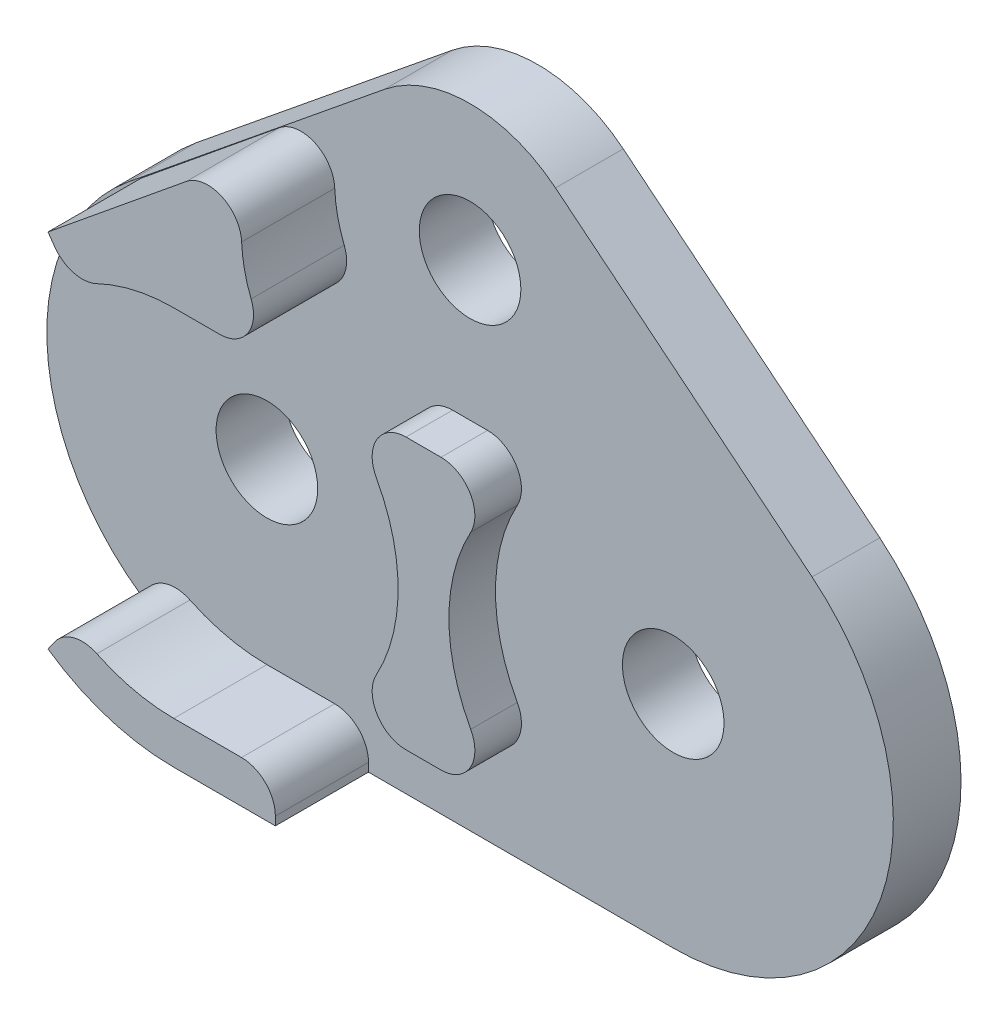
ISO-10303-21;
HEADER;
FILE_DESCRIPTION(('STEP AP214'),'2;1');
FILE_NAME('part.step','',(''),(''),'','','');
FILE_SCHEMA(('AUTOMOTIVE_DESIGN { 1 0 10303 214 1 1 1 1 }'));
ENDSEC;
DATA;
#1=APPLICATION_CONTEXT('core data for automotive mechanical design processes');
#2=APPLICATION_PROTOCOL_DEFINITION('international standard','automotive_design',2000,#1);
#3=PRODUCT_CONTEXT('',#1,'mechanical');
#4=PRODUCT('Part','Part','',(#3));
#5=PRODUCT_RELATED_PRODUCT_CATEGORY('part','',(#4));
#6=PRODUCT_DEFINITION_FORMATION('','',#4);
#7=PRODUCT_DEFINITION_CONTEXT('part definition',#1,'design');
#8=PRODUCT_DEFINITION('design','',#6,#7);
#9=PRODUCT_DEFINITION_SHAPE('','',#8);
#10=(LENGTH_UNIT() NAMED_UNIT(*) SI_UNIT(.MILLI.,.METRE.));
#11=(NAMED_UNIT(*) PLANE_ANGLE_UNIT() SI_UNIT($,.RADIAN.));
#12=(NAMED_UNIT(*) SI_UNIT($,.STERADIAN.) SOLID_ANGLE_UNIT());
#13=UNCERTAINTY_MEASURE_WITH_UNIT(LENGTH_MEASURE(1.E-05),#10,'distance_accuracy_value','');
#14=(GEOMETRIC_REPRESENTATION_CONTEXT(3) GLOBAL_UNCERTAINTY_ASSIGNED_CONTEXT((#13)) GLOBAL_UNIT_ASSIGNED_CONTEXT((#10,
#11,#12)) REPRESENTATION_CONTEXT('',''));
#15=CARTESIAN_POINT('',(0.,0.,0.));
#16=DIRECTION('',(0.,0.,1.));
#17=DIRECTION('',(1.,0.,0.));
#18=AXIS2_PLACEMENT_3D('',#15,#16,#17);
#19=CARTESIAN_POINT('',(-6.,0.,2.));
#20=DIRECTION('',(0.,0.,1.));
#21=DIRECTION('',(1.,0.,0.));
#22=AXIS2_PLACEMENT_3D('',#19,#20,#21);
#23=PLANE('',#22);
#24=CARTESIAN_POINT('',(0.,8.1,2.));
#25=DIRECTION('',(0.,0.,1.));
#26=DIRECTION('',(-1.,0.,0.));
#27=AXIS2_PLACEMENT_3D('',#24,#25,#26);
#28=CIRCLE('',#27,4.);
#29=CARTESIAN_POINT('',(2.52331386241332,11.2036892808,2.));
#30=VERTEX_POINT('',#29);
#31=CARTESIAN_POINT('',(-2.52331386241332,11.2036892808,2.));
#32=VERTEX_POINT('',#31);
#33=EDGE_CURVE('E327',#30,#32,#28,.T.);
#34=ORIENTED_EDGE('',*,*,#33,.T.);
#35=DIRECTION('',(-0.775922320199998,-0.63082846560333,0.));
#36=VECTOR('',#35,1.);
#37=CARTESIAN_POINT('',(-2.52331386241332,11.2036892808,2.));
#38=LINE('',#37,#36);
#39=CARTESIAN_POINT('',(-10.1003850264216,5.04349508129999,2.));
#40=VERTEX_POINT('',#39);
#41=EDGE_CURVE('E329',#32,#40,#38,.T.);
#42=ORIENTED_EDGE('',*,*,#41,.T.);
#43=CARTESIAN_POINT('',(-6.,0.,2.));
#44=DIRECTION('',(0.,0.,1.));
#45=DIRECTION('',(1.,0.,0.));
#46=AXIS2_PLACEMENT_3D('',#43,#44,#45);
#47=CIRCLE('',#46,6.5);
#48=CARTESIAN_POINT('',(-9.71428571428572,-5.33423674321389,2.));
#49=VERTEX_POINT('',#48);
#50=EDGE_CURVE('E356',#40,#49,#47,.T.);
#51=ORIENTED_EDGE('',*,*,#50,.T.);
#52=DIRECTION('',(-0.571428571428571,-0.82065180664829,0.));
#53=VECTOR('',#52,1.);
#54=CARTESIAN_POINT('',(-4.04081632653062,2.81366333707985,2.));
#55=LINE('',#54,#53);
#56=CARTESIAN_POINT('',(-9.52541790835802,-5.06299600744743,2.));
#57=VERTEX_POINT('',#56);
#58=EDGE_CURVE('E256',#57,#49,#55,.T.);
#59=ORIENTED_EDGE('',*,*,#58,.F.);
#60=CARTESIAN_POINT('',(-8.70476610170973,-5.634424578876,2.));
#61=DIRECTION('',(0.,0.,1.));
#62=DIRECTION('',(1.,0.,0.));
#63=AXIS2_PLACEMENT_3D('',#60,#61,#62);
#64=CIRCLE('',#63,1.);
#65=CARTESIAN_POINT('',(-8.27200352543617,-4.73291664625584,2.));
#66=VERTEX_POINT('',#65);
#67=EDGE_CURVE('E443',#57,#66,#64,.F.);
#68=ORIENTED_EDGE('',*,*,#67,.T.);
#69=CARTESIAN_POINT('',(-6.,0.,2.));
#70=DIRECTION('',(0.,0.,1.));
#71=DIRECTION('',(1.,0.,0.));
#72=AXIS2_PLACEMENT_3D('',#69,#70,#71);
#73=CIRCLE('',#72,5.25);
#74=CARTESIAN_POINT('',(-6.,-5.25,2.));
#75=VERTEX_POINT('',#74);
#76=EDGE_CURVE('E273',#75,#66,#73,.F.);
#77=ORIENTED_EDGE('',*,*,#76,.F.);
#78=DIRECTION('',(1.,0.,0.));
#79=VECTOR('',#78,1.);
#80=CARTESIAN_POINT('',(0.,-5.25,2.));
#81=LINE('',#80,#79);
#82=CARTESIAN_POINT('',(-4.,-5.25,2.));
#83=VERTEX_POINT('',#82);
#84=EDGE_CURVE('E235',#75,#83,#81,.T.);
#85=ORIENTED_EDGE('',*,*,#84,.T.);
#86=CARTESIAN_POINT('',(-4.,-6.25,2.));
#87=DIRECTION('',(0.,0.,1.));
#88=DIRECTION('',(1.,0.,0.));
#89=AXIS2_PLACEMENT_3D('',#86,#87,#88);
#90=CIRCLE('',#89,1.);
#91=CARTESIAN_POINT('',(-3.,-6.25,2.));
#92=VERTEX_POINT('',#91);
#93=EDGE_CURVE('E441',#83,#92,#90,.F.);
#94=ORIENTED_EDGE('',*,*,#93,.T.);
#95=DIRECTION('',(0.,-1.,0.));
#96=VECTOR('',#95,1.);
#97=CARTESIAN_POINT('',(-3.,0.,2.));
#98=LINE('',#97,#96);
#99=CARTESIAN_POINT('',(-3.,-6.5,2.));
#100=VERTEX_POINT('',#99);
#101=EDGE_CURVE('E254',#92,#100,#98,.T.);
#102=ORIENTED_EDGE('',*,*,#101,.T.);
#103=DIRECTION('',(1.,0.,0.));
#104=VECTOR('',#103,1.);
#105=CARTESIAN_POINT('',(-6.,-6.5,2.));
#106=LINE('',#105,#104);
#107=CARTESIAN_POINT('',(6.,-6.50000000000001,2.));
#108=VERTEX_POINT('',#107);
#109=EDGE_CURVE('E359',#100,#108,#106,.T.);
#110=ORIENTED_EDGE('',*,*,#109,.T.);
#111=CARTESIAN_POINT('',(6.,0.,2.));
#112=DIRECTION('',(0.,0.,1.));
#113=DIRECTION('',(-1.,0.,0.));
#114=AXIS2_PLACEMENT_3D('',#111,#112,#113);
#115=CIRCLE('',#114,6.5);
#116=CARTESIAN_POINT('',(10.1003850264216,5.04349508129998,2.));
#117=VERTEX_POINT('',#116);
#118=EDGE_CURVE('E362',#108,#117,#115,.T.);
#119=ORIENTED_EDGE('',*,*,#118,.T.);
#120=DIRECTION('',(-0.775922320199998,0.63082846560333,0.));
#121=VECTOR('',#120,1.);
#122=CARTESIAN_POINT('',(2.52331386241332,11.2036892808,2.));
#123=LINE('',#122,#121);
#124=EDGE_CURVE('E324',#117,#30,#123,.T.);
#125=ORIENTED_EDGE('',*,*,#124,.T.);
#126=EDGE_LOOP('',(#34,#42,#51,#59,#68,#77,#85,#94,#102,#110,#119,#125));
#127=FACE_BOUND('',#126,.T.);
#128=CARTESIAN_POINT('',(-4.9957863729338,7.89477203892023,2.));
#129=DIRECTION('',(0.,0.,1.));
#130=DIRECTION('',(1.,0.,0.));
#131=AXIS2_PLACEMENT_3D('',#128,#129,#130);
#132=CIRCLE('',#131,1.);
#133=CARTESIAN_POINT('',(-5.6281157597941,8.66947168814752,2.));
#134=VERTEX_POINT('',#133);
#135=CARTESIAN_POINT('',(-3.99662909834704,7.93581763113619,2.));
#136=VERTEX_POINT('',#135);
#137=EDGE_CURVE('E11',#134,#136,#132,.F.);
#138=ORIENTED_EDGE('',*,*,#137,.T.);
#139=CARTESIAN_POINT('',(0.,8.1,2.));
#140=DIRECTION('',(0.,0.,1.));
#141=DIRECTION('',(1.,0.,0.));
#142=AXIS2_PLACEMENT_3D('',#139,#140,#141);
#143=CIRCLE('',#142,4.);
#144=CARTESIAN_POINT('',(-3.71612701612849,6.62,2.));
#145=VERTEX_POINT('',#144);
#146=EDGE_CURVE('E50',#145,#136,#143,.F.);
#147=ORIENTED_EDGE('',*,*,#146,.F.);
#148=CARTESIAN_POINT('',(-4.64515877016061,6.25,2.));
#149=DIRECTION('',(0.,0.,1.));
#150=DIRECTION('',(1.,0.,0.));
#151=AXIS2_PLACEMENT_3D('',#148,#149,#150);
#152=CIRCLE('',#151,1.);
#153=CARTESIAN_POINT('',(-4.64515877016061,5.25,2.));
#154=VERTEX_POINT('',#153);
#155=EDGE_CURVE('E43',#145,#154,#152,.F.);
#156=ORIENTED_EDGE('',*,*,#155,.T.);
#157=DIRECTION('',(1.,0.,0.));
#158=VECTOR('',#157,1.);
#159=CARTESIAN_POINT('',(0.,5.25,2.));
#160=LINE('',#159,#158);
#161=CARTESIAN_POINT('',(-6.,5.25,2.));
#162=VERTEX_POINT('',#161);
#163=EDGE_CURVE('E238',#162,#154,#160,.T.);
#164=ORIENTED_EDGE('',*,*,#163,.F.);
#165=CARTESIAN_POINT('',(-6.,0.,2.));
#166=DIRECTION('',(0.,0.,1.));
#167=DIRECTION('',(1.,0.,0.));
#168=AXIS2_PLACEMENT_3D('',#165,#166,#167);
#169=CIRCLE('',#168,5.25);
#170=CARTESIAN_POINT('',(-8.27200352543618,4.73291664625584,2.));
#171=VERTEX_POINT('',#170);
#172=EDGE_CURVE('E285',#162,#171,#169,.T.);
#173=ORIENTED_EDGE('',*,*,#172,.T.);
#174=CARTESIAN_POINT('',(-8.70476610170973,5.634424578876,2.));
#175=DIRECTION('',(0.,0.,1.));
#176=DIRECTION('',(1.,0.,0.));
#177=AXIS2_PLACEMENT_3D('',#174,#175,#176);
#178=CIRCLE('',#177,1.);
#179=CARTESIAN_POINT('',(-9.52541790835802,5.06299600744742,2.));
#180=VERTEX_POINT('',#179);
#181=EDGE_CURVE('E445',#171,#180,#178,.F.);
#182=ORIENTED_EDGE('',*,*,#181,.T.);
#183=DIRECTION('',(-0.571428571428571,0.82065180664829,0.));
#184=VECTOR('',#183,1.);
#185=CARTESIAN_POINT('',(-4.04081632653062,-2.81366333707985,2.));
#186=LINE('',#185,#184);
#187=CARTESIAN_POINT('',(-9.71428571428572,5.33423674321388,2.));
#188=VERTEX_POINT('',#187);
#189=EDGE_CURVE('E303',#180,#188,#186,.T.);
#190=ORIENTED_EDGE('',*,*,#189,.T.);
#191=DIRECTION('',(0.774699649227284,0.6323293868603,0.));
#192=VECTOR('',#191,1.);
#193=CARTESIAN_POINT('',(-6.49722217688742,7.96008511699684,2.));
#194=LINE('',#193,#192);
#195=EDGE_CURVE('E300',#188,#134,#194,.T.);
#196=ORIENTED_EDGE('',*,*,#195,.T.);
#197=EDGE_LOOP('',(#138,#147,#156,#164,#173,#182,#190,#196));
#198=FACE_BOUND('',#197,.T.);
#199=CARTESIAN_POINT('',(6.,0.,2.));
#200=DIRECTION('',(0.,0.,1.));
#201=DIRECTION('',(1.,0.,0.));
#202=AXIS2_PLACEMENT_3D('',#199,#200,#201);
#203=CIRCLE('',#202,1.5);
#204=CARTESIAN_POINT('',(7.5,0.,2.));
#205=VERTEX_POINT('',#204);
#206=EDGE_CURVE('E343',#205,#205,#203,.T.);
#207=ORIENTED_EDGE('',*,*,#206,.F.);
#208=EDGE_LOOP('',(#207));
#209=FACE_BOUND('',#208,.T.);
#210=CARTESIAN_POINT('',(-6.,0.,2.));
#211=DIRECTION('',(0.,0.,1.));
#212=DIRECTION('',(1.,0.,0.));
#213=AXIS2_PLACEMENT_3D('',#210,#211,#212);
#214=CIRCLE('',#213,1.5);
#215=CARTESIAN_POINT('',(-4.5,0.,2.));
#216=VERTEX_POINT('',#215);
#217=EDGE_CURVE('E347',#216,#216,#214,.T.);
#218=ORIENTED_EDGE('',*,*,#217,.F.);
#219=EDGE_LOOP('',(#218));
#220=FACE_BOUND('',#219,.T.);
#221=CARTESIAN_POINT('',(0.,8.1,2.));
#222=DIRECTION('',(0.,0.,1.));
#223=DIRECTION('',(1.,0.,0.));
#224=AXIS2_PLACEMENT_3D('',#221,#222,#223);
#225=CIRCLE('',#224,1.5);
#226=CARTESIAN_POINT('',(1.5,8.1,2.));
#227=VERTEX_POINT('',#226);
#228=EDGE_CURVE('E312',#227,#227,#225,.T.);
#229=ORIENTED_EDGE('',*,*,#228,.F.);
#230=EDGE_LOOP('',(#229));
#231=FACE_BOUND('',#230,.T.);
#232=DIRECTION('',(1.,0.,0.));
#233=VECTOR('',#232,1.);
#234=CARTESIAN_POINT('',(-2.59963237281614,-4.,2.));
#235=LINE('',#234,#233);
#236=CARTESIAN_POINT('',(-0.517071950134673,-4.,2.));
#237=VERTEX_POINT('',#236);
#238=CARTESIAN_POINT('',(0.517071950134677,-4.,2.));
#239=VERTEX_POINT('',#238);
#240=EDGE_CURVE('E837',#237,#239,#235,.T.);
#241=ORIENTED_EDGE('',*,*,#240,.F.);
#242=CARTESIAN_POINT('',(-0.517071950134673,-3.,2.));
#243=DIRECTION('',(0.,0.,1.));
#244=DIRECTION('',(1.,0.,0.));
#245=AXIS2_PLACEMENT_3D('',#242,#243,#244);
#246=CIRCLE('',#245,1.);
#247=CARTESIAN_POINT('',(-1.39434043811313,-2.52,2.));
#248=VERTEX_POINT('',#247);
#249=EDGE_CURVE('E433',#237,#248,#246,.F.);
#250=ORIENTED_EDGE('',*,*,#249,.T.);
#251=CARTESIAN_POINT('',(-6.,0.,2.));
#252=DIRECTION('',(0.,0.,-1.));
#253=DIRECTION('',(-1.,0.,0.));
#254=AXIS2_PLACEMENT_3D('',#251,#252,#253);
#255=CIRCLE('',#254,5.25);
#256=CARTESIAN_POINT('',(-1.39434043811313,2.52,2.));
#257=VERTEX_POINT('',#256);
#258=EDGE_CURVE('E843',#257,#248,#255,.T.);
#259=ORIENTED_EDGE('',*,*,#258,.F.);
#260=CARTESIAN_POINT('',(-0.517071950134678,3.,2.));
#261=DIRECTION('',(0.,0.,1.));
#262=DIRECTION('',(1.,0.,0.));
#263=AXIS2_PLACEMENT_3D('',#260,#261,#262);
#264=CIRCLE('',#263,1.);
#265=CARTESIAN_POINT('',(-0.517071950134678,4.,2.));
#266=VERTEX_POINT('',#265);
#267=EDGE_CURVE('E439',#257,#266,#264,.F.);
#268=ORIENTED_EDGE('',*,*,#267,.T.);
#269=DIRECTION('',(-1.,0.,0.));
#270=VECTOR('',#269,1.);
#271=CARTESIAN_POINT('',(-2.59963237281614,4.,2.));
#272=LINE('',#271,#270);
#273=CARTESIAN_POINT('',(0.51707195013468,4.,2.));
#274=VERTEX_POINT('',#273);
#275=EDGE_CURVE('E259',#274,#266,#272,.T.);
#276=ORIENTED_EDGE('',*,*,#275,.F.);
#277=CARTESIAN_POINT('',(0.51707195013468,3.,2.));
#278=DIRECTION('',(0.,0.,1.));
#279=DIRECTION('',(1.,0.,0.));
#280=AXIS2_PLACEMENT_3D('',#277,#278,#279);
#281=CIRCLE('',#280,1.);
#282=CARTESIAN_POINT('',(1.39434043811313,2.52,2.));
#283=VERTEX_POINT('',#282);
#284=EDGE_CURVE('E437',#274,#283,#281,.F.);
#285=ORIENTED_EDGE('',*,*,#284,.T.);
#286=CARTESIAN_POINT('',(6.,0.,2.));
#287=DIRECTION('',(0.,0.,-1.));
#288=DIRECTION('',(1.,0.,0.));
#289=AXIS2_PLACEMENT_3D('',#286,#287,#288);
#290=CIRCLE('',#289,5.25);
#291=CARTESIAN_POINT('',(1.39434043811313,-2.52,2.));
#292=VERTEX_POINT('',#291);
#293=EDGE_CURVE('E842',#292,#283,#290,.T.);
#294=ORIENTED_EDGE('',*,*,#293,.F.);
#295=CARTESIAN_POINT('',(0.517071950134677,-3.,2.));
#296=DIRECTION('',(0.,0.,1.));
#297=DIRECTION('',(1.,0.,0.));
#298=AXIS2_PLACEMENT_3D('',#295,#296,#297);
#299=CIRCLE('',#298,1.);
#300=EDGE_CURVE('E435',#292,#239,#299,.F.);
#301=ORIENTED_EDGE('',*,*,#300,.T.);
#302=EDGE_LOOP('',(#241,#250,#259,#268,#276,#285,#294,#301));
#303=FACE_BOUND('',#302,.T.);
#304=ADVANCED_FACE('F35',(#127,#198,#209,#220,#231,#303),#23,.T.);
#305=CARTESIAN_POINT('',(6.,0.,2.));
#306=DIRECTION('',(0.,0.,-1.));
#307=DIRECTION('',(-1.,0.,0.));
#308=AXIS2_PLACEMENT_3D('',#305,#306,#307);
#309=CYLINDRICAL_SURFACE('',#308,6.5);
#310=DIRECTION('',(0.,0.,1.));
#311=VECTOR('',#310,1.);
#312=CARTESIAN_POINT('',(10.1003850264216,5.04349508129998,-21.3977889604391));
#313=LINE('',#312,#311);
#314=CARTESIAN_POINT('',(10.1003850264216,5.04349508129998,0.));
#315=VERTEX_POINT('',#314);
#316=EDGE_CURVE('E332',#315,#117,#313,.T.);
#317=ORIENTED_EDGE('',*,*,#316,.T.);
#318=ORIENTED_EDGE('',*,*,#118,.F.);
#319=DIRECTION('',(0.,0.,-1.));
#320=VECTOR('',#319,1.);
#321=CARTESIAN_POINT('',(6.,-6.50000000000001,2.));
#322=LINE('',#321,#320);
#323=CARTESIAN_POINT('',(6.,-6.50000000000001,0.));
#324=VERTEX_POINT('',#323);
#325=EDGE_CURVE('E365',#108,#324,#322,.T.);
#326=ORIENTED_EDGE('',*,*,#325,.T.);
#327=CARTESIAN_POINT('',(6.,0.,0.));
#328=DIRECTION('',(0.,0.,1.));
#329=DIRECTION('',(-1.,0.,0.));
#330=AXIS2_PLACEMENT_3D('',#327,#328,#329);
#331=CIRCLE('',#330,6.5);
#332=EDGE_CURVE('E360',#324,#315,#331,.T.);
#333=ORIENTED_EDGE('',*,*,#332,.T.);
#334=EDGE_LOOP('',(#317,#318,#326,#333));
#335=FACE_BOUND('',#334,.T.);
#336=ADVANCED_FACE('F488',(#335),#309,.T.);
#337=CARTESIAN_POINT('',(-6.,0.,2.));
#338=DIRECTION('',(0.,0.,-1.));
#339=DIRECTION('',(-1.,0.,0.));
#340=AXIS2_PLACEMENT_3D('',#337,#338,#339);
#341=CYLINDRICAL_SURFACE('',#340,6.5);
#342=ORIENTED_EDGE('',*,*,#50,.F.);
#343=DIRECTION('',(0.,0.,1.));
#344=VECTOR('',#343,1.);
#345=CARTESIAN_POINT('',(-10.1003850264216,5.04349508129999,-21.3977889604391));
#346=LINE('',#345,#344);
#347=CARTESIAN_POINT('',(-10.1003850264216,5.04349508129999,0.));
#348=VERTEX_POINT('',#347);
#349=EDGE_CURVE('E317',#348,#40,#346,.T.);
#350=ORIENTED_EDGE('',*,*,#349,.F.);
#351=CARTESIAN_POINT('',(-6.,0.,0.));
#352=DIRECTION('',(0.,0.,1.));
#353=DIRECTION('',(1.,0.,0.));
#354=AXIS2_PLACEMENT_3D('',#351,#352,#353);
#355=CIRCLE('',#354,6.5);
#356=CARTESIAN_POINT('',(-6.,-6.5,0.));
#357=VERTEX_POINT('',#356);
#358=EDGE_CURVE('E353',#348,#357,#355,.T.);
#359=ORIENTED_EDGE('',*,*,#358,.T.);
#360=DIRECTION('',(0.,0.,-1.));
#361=VECTOR('',#360,1.);
#362=CARTESIAN_POINT('',(-6.,-6.5,2.));
#363=LINE('',#362,#361);
#364=CARTESIAN_POINT('',(-6.,-6.5,4.75));
#365=VERTEX_POINT('',#364);
#366=EDGE_CURVE('E372',#365,#357,#363,.T.);
#367=ORIENTED_EDGE('',*,*,#366,.F.);
#368=CARTESIAN_POINT('',(-6.,0.,4.75));
#369=DIRECTION('',(0.,0.,1.));
#370=DIRECTION('',(1.,0.,0.));
#371=AXIS2_PLACEMENT_3D('',#368,#369,#370);
#372=CIRCLE('',#371,6.5);
#373=CARTESIAN_POINT('',(-9.71428571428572,-5.33423674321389,4.75));
#374=VERTEX_POINT('',#373);
#375=EDGE_CURVE('E263',#374,#365,#372,.T.);
#376=ORIENTED_EDGE('',*,*,#375,.F.);
#377=DIRECTION('',(0.,0.,-1.));
#378=VECTOR('',#377,1.);
#379=CARTESIAN_POINT('',(-9.71428571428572,-5.33423674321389,4.75));
#380=LINE('',#379,#378);
#381=EDGE_CURVE('E239',#374,#49,#380,.T.);
#382=ORIENTED_EDGE('',*,*,#381,.T.);
#383=EDGE_LOOP('',(#342,#350,#359,#367,#376,#382));
#384=FACE_BOUND('',#383,.T.);
#385=ADVANCED_FACE('F494',(#384),#341,.T.);
#386=CARTESIAN_POINT('',(-6.,-6.5,2.));
#387=DIRECTION('',(0.,1.,0.));
#388=DIRECTION('',(0.,0.,1.));
#389=AXIS2_PLACEMENT_3D('',#386,#387,#388);
#390=PLANE('',#389);
#391=DIRECTION('',(1.,0.,0.));
#392=VECTOR('',#391,1.);
#393=CARTESIAN_POINT('',(-6.,-6.5,0.));
#394=LINE('',#393,#392);
#395=EDGE_CURVE('E367',#357,#324,#394,.T.);
#396=ORIENTED_EDGE('',*,*,#395,.T.);
#397=ORIENTED_EDGE('',*,*,#325,.F.);
#398=ORIENTED_EDGE('',*,*,#109,.F.);
#399=DIRECTION('',(0.,0.,-1.));
#400=VECTOR('',#399,1.);
#401=CARTESIAN_POINT('',(-3.,-6.5,4.75));
#402=LINE('',#401,#400);
#403=CARTESIAN_POINT('',(-3.,-6.5,4.75));
#404=VERTEX_POINT('',#403);
#405=EDGE_CURVE('E271',#404,#100,#402,.T.);
#406=ORIENTED_EDGE('',*,*,#405,.F.);
#407=DIRECTION('',(1.,0.,0.));
#408=VECTOR('',#407,1.);
#409=CARTESIAN_POINT('',(0.,-6.5,4.75));
#410=LINE('',#409,#408);
#411=EDGE_CURVE('E266',#365,#404,#410,.T.);
#412=ORIENTED_EDGE('',*,*,#411,.F.);
#413=ORIENTED_EDGE('',*,*,#366,.T.);
#414=EDGE_LOOP('',(#396,#397,#398,#406,#412,#413));
#415=FACE_BOUND('',#414,.T.);
#416=ADVANCED_FACE('F503',(#415),#390,.F.);
#417=CARTESIAN_POINT('',(-6.,0.,0.));
#418=DIRECTION('',(0.,0.,1.));
#419=DIRECTION('',(1.,0.,0.));
#420=AXIS2_PLACEMENT_3D('',#417,#418,#419);
#421=PLANE('',#420);
#422=ORIENTED_EDGE('',*,*,#358,.F.);
#423=DIRECTION('',(0.775922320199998,0.63082846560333,0.));
#424=VECTOR('',#423,1.);
#425=CARTESIAN_POINT('',(-2.52331386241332,11.2036892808,0.));
#426=LINE('',#425,#424);
#427=CARTESIAN_POINT('',(-2.52331386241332,11.2036892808,0.));
#428=VERTEX_POINT('',#427);
#429=EDGE_CURVE('E319',#348,#428,#426,.T.);
#430=ORIENTED_EDGE('',*,*,#429,.T.);
#431=CARTESIAN_POINT('',(0.,8.1,0.));
#432=DIRECTION('',(0.,0.,1.));
#433=DIRECTION('',(1.,0.,0.));
#434=AXIS2_PLACEMENT_3D('',#431,#432,#433);
#435=CIRCLE('',#434,4.);
#436=CARTESIAN_POINT('',(2.52331386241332,11.2036892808,0.));
#437=VERTEX_POINT('',#436);
#438=EDGE_CURVE('E316',#428,#437,#435,.F.);
#439=ORIENTED_EDGE('',*,*,#438,.T.);
#440=DIRECTION('',(0.775922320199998,-0.63082846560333,0.));
#441=VECTOR('',#440,1.);
#442=CARTESIAN_POINT('',(2.52331386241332,11.2036892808,0.));
#443=LINE('',#442,#441);
#444=EDGE_CURVE('E313',#437,#315,#443,.T.);
#445=ORIENTED_EDGE('',*,*,#444,.T.);
#446=ORIENTED_EDGE('',*,*,#332,.F.);
#447=ORIENTED_EDGE('',*,*,#395,.F.);
#448=EDGE_LOOP('',(#422,#430,#439,#445,#446,#447));
#449=FACE_BOUND('',#448,.T.);
#450=CARTESIAN_POINT('',(6.,0.,0.));
#451=DIRECTION('',(0.,0.,1.));
#452=DIRECTION('',(1.,0.,0.));
#453=AXIS2_PLACEMENT_3D('',#450,#451,#452);
#454=CIRCLE('',#453,1.5);
#455=CARTESIAN_POINT('',(7.5,0.,0.));
#456=VERTEX_POINT('',#455);
#457=EDGE_CURVE('E344',#456,#456,#454,.T.);
#458=ORIENTED_EDGE('',*,*,#457,.T.);
#459=EDGE_LOOP('',(#458));
#460=FACE_BOUND('',#459,.T.);
#461=CARTESIAN_POINT('',(-6.,0.,0.));
#462=DIRECTION('',(0.,0.,1.));
#463=DIRECTION('',(1.,0.,0.));
#464=AXIS2_PLACEMENT_3D('',#461,#462,#463);
#465=CIRCLE('',#464,1.5);
#466=CARTESIAN_POINT('',(-4.5,0.,0.));
#467=VERTEX_POINT('',#466);
#468=EDGE_CURVE('E350',#467,#467,#465,.T.);
#469=ORIENTED_EDGE('',*,*,#468,.T.);
#470=EDGE_LOOP('',(#469));
#471=FACE_BOUND('',#470,.T.);
#472=CARTESIAN_POINT('',(0.,8.1,0.));
#473=DIRECTION('',(0.,0.,1.));
#474=DIRECTION('',(1.,0.,0.));
#475=AXIS2_PLACEMENT_3D('',#472,#473,#474);
#476=CIRCLE('',#475,1.5);
#477=CARTESIAN_POINT('',(1.5,8.1,0.));
#478=VERTEX_POINT('',#477);
#479=EDGE_CURVE('E321',#478,#478,#476,.F.);
#480=ORIENTED_EDGE('',*,*,#479,.F.);
#481=EDGE_LOOP('',(#480));
#482=FACE_BOUND('',#481,.T.);
#483=ADVANCED_FACE('F501',(#449,#460,#471,#482),#421,.F.);
#484=CARTESIAN_POINT('',(-6.,0.,0.));
#485=DIRECTION('',(0.,0.,1.));
#486=DIRECTION('',(1.,0.,0.));
#487=AXIS2_PLACEMENT_3D('',#484,#485,#486);
#488=CYLINDRICAL_SURFACE('',#487,1.5);
#489=ORIENTED_EDGE('',*,*,#468,.F.);
#490=EDGE_LOOP('',(#489));
#491=FACE_BOUND('',#490,.T.);
#492=ORIENTED_EDGE('',*,*,#217,.T.);
#493=EDGE_LOOP('',(#492));
#494=FACE_BOUND('',#493,.T.);
#495=ADVANCED_FACE('F499',(#491,#494),#488,.F.);
#496=CARTESIAN_POINT('',(6.,0.,0.));
#497=DIRECTION('',(0.,0.,1.));
#498=DIRECTION('',(1.,0.,0.));
#499=AXIS2_PLACEMENT_3D('',#496,#497,#498);
#500=CYLINDRICAL_SURFACE('',#499,1.5);
#501=ORIENTED_EDGE('',*,*,#457,.F.);
#502=EDGE_LOOP('',(#501));
#503=FACE_BOUND('',#502,.T.);
#504=ORIENTED_EDGE('',*,*,#206,.T.);
#505=EDGE_LOOP('',(#504));
#506=FACE_BOUND('',#505,.T.);
#507=ADVANCED_FACE('F782',(#503,#506),#500,.F.);
#508=CARTESIAN_POINT('',(2.52331386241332,11.2036892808,-21.3977889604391));
#509=DIRECTION('',(0.63082846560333,0.775922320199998,0.));
#510=DIRECTION('',(-0.775922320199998,0.63082846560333,0.));
#511=AXIS2_PLACEMENT_3D('',#508,#509,#510);
#512=PLANE('',#511);
#513=ORIENTED_EDGE('',*,*,#444,.F.);
#514=DIRECTION('',(0.,0.,1.));
#515=VECTOR('',#514,1.);
#516=CARTESIAN_POINT('',(2.52331386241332,11.2036892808,-21.3977889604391));
#517=LINE('',#516,#515);
#518=EDGE_CURVE('E338',#437,#30,#517,.T.);
#519=ORIENTED_EDGE('',*,*,#518,.T.);
#520=ORIENTED_EDGE('',*,*,#124,.F.);
#521=ORIENTED_EDGE('',*,*,#316,.F.);
#522=EDGE_LOOP('',(#513,#519,#520,#521));
#523=FACE_BOUND('',#522,.T.);
#524=ADVANCED_FACE('F772',(#523),#512,.T.);
#525=CARTESIAN_POINT('',(0.,8.1,-21.3977889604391));
#526=DIRECTION('',(0.,0.,1.));
#527=DIRECTION('',(1.,0.,0.));
#528=AXIS2_PLACEMENT_3D('',#525,#526,#527);
#529=CYLINDRICAL_SURFACE('',#528,4.);
#530=ORIENTED_EDGE('',*,*,#438,.F.);
#531=DIRECTION('',(0.,0.,1.));
#532=VECTOR('',#531,1.);
#533=CARTESIAN_POINT('',(-2.52331386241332,11.2036892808,-21.3977889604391));
#534=LINE('',#533,#532);
#535=EDGE_CURVE('E335',#428,#32,#534,.T.);
#536=ORIENTED_EDGE('',*,*,#535,.T.);
#537=ORIENTED_EDGE('',*,*,#33,.F.);
#538=ORIENTED_EDGE('',*,*,#518,.F.);
#539=EDGE_LOOP('',(#530,#536,#537,#538));
#540=FACE_BOUND('',#539,.T.);
#541=ADVANCED_FACE('F762',(#540),#529,.T.);
#542=CARTESIAN_POINT('',(-2.52331386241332,11.2036892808,-21.3977889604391));
#543=DIRECTION('',(-0.63082846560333,0.775922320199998,0.));
#544=DIRECTION('',(-0.775922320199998,-0.63082846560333,0.));
#545=AXIS2_PLACEMENT_3D('',#542,#543,#544);
#546=PLANE('',#545);
#547=ORIENTED_EDGE('',*,*,#429,.F.);
#548=ORIENTED_EDGE('',*,*,#349,.T.);
#549=ORIENTED_EDGE('',*,*,#41,.F.);
#550=ORIENTED_EDGE('',*,*,#535,.F.);
#551=EDGE_LOOP('',(#547,#548,#549,#550));
#552=FACE_BOUND('',#551,.T.);
#553=ADVANCED_FACE('F752',(#552),#546,.T.);
#554=CARTESIAN_POINT('',(0.,8.1,-21.3977889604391));
#555=DIRECTION('',(0.,0.,1.));
#556=DIRECTION('',(1.,0.,0.));
#557=AXIS2_PLACEMENT_3D('',#554,#555,#556);
#558=CYLINDRICAL_SURFACE('',#557,1.5);
#559=ORIENTED_EDGE('',*,*,#479,.T.);
#560=EDGE_LOOP('',(#559));
#561=FACE_BOUND('',#560,.T.);
#562=ORIENTED_EDGE('',*,*,#228,.T.);
#563=EDGE_LOOP('',(#562));
#564=FACE_BOUND('',#563,.T.);
#565=ADVANCED_FACE('F725',(#561,#564),#558,.F.);
#566=CARTESIAN_POINT('',(0.,5.25,4.75));
#567=DIRECTION('',(0.,1.,0.));
#568=DIRECTION('',(0.,0.,1.));
#569=AXIS2_PLACEMENT_3D('',#566,#567,#568);
#570=PLANE('',#569);
#571=ORIENTED_EDGE('',*,*,#163,.T.);
#572=DIRECTION('',(0.,0.,-1.));
#573=VECTOR('',#572,1.);
#574=CARTESIAN_POINT('',(-4.64515877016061,5.25,4.75));
#575=LINE('',#574,#573);
#576=CARTESIAN_POINT('',(-4.64515877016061,5.25,4.75));
#577=VERTEX_POINT('',#576);
#578=EDGE_CURVE('E429',#154,#577,#575,.F.);
#579=ORIENTED_EDGE('',*,*,#578,.T.);
#580=DIRECTION('',(1.,0.,0.));
#581=VECTOR('',#580,1.);
#582=CARTESIAN_POINT('',(0.,5.25,4.75));
#583=LINE('',#582,#581);
#584=CARTESIAN_POINT('',(-6.,5.25,4.75));
#585=VERTEX_POINT('',#584);
#586=EDGE_CURVE('E281',#585,#577,#583,.T.);
#587=ORIENTED_EDGE('',*,*,#586,.F.);
#588=DIRECTION('',(0.,0.,-1.));
#589=VECTOR('',#588,1.);
#590=CARTESIAN_POINT('',(-6.,5.25,4.75));
#591=LINE('',#590,#589);
#592=EDGE_CURVE('E296',#585,#162,#591,.T.);
#593=ORIENTED_EDGE('',*,*,#592,.T.);
#594=EDGE_LOOP('',(#571,#579,#587,#593));
#595=FACE_BOUND('',#594,.T.);
#596=ADVANCED_FACE('F452',(#595),#570,.F.);
#597=CARTESIAN_POINT('',(0.,8.1,4.75));
#598=DIRECTION('',(0.,0.,-1.));
#599=DIRECTION('',(-1.,0.,0.));
#600=AXIS2_PLACEMENT_3D('',#597,#598,#599);
#601=CYLINDRICAL_SURFACE('',#600,4.);
#602=CARTESIAN_POINT('',(0.,8.1,4.75));
#603=DIRECTION('',(0.,0.,1.));
#604=DIRECTION('',(1.,0.,0.));
#605=AXIS2_PLACEMENT_3D('',#602,#603,#604);
#606=CIRCLE('',#605,4.);
#607=CARTESIAN_POINT('',(-3.71612701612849,6.62,4.75));
#608=VERTEX_POINT('',#607);
#609=CARTESIAN_POINT('',(-3.99662909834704,7.93581763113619,4.75));
#610=VERTEX_POINT('',#609);
#611=EDGE_CURVE('E284',#608,#610,#606,.F.);
#612=ORIENTED_EDGE('',*,*,#611,.F.);
#613=DIRECTION('',(0.,0.,-1.));
#614=VECTOR('',#613,1.);
#615=CARTESIAN_POINT('',(-3.71612701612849,6.62,4.75));
#616=LINE('',#615,#614);
#617=EDGE_CURVE('E427',#608,#145,#616,.T.);
#618=ORIENTED_EDGE('',*,*,#617,.T.);
#619=ORIENTED_EDGE('',*,*,#146,.T.);
#620=DIRECTION('',(0.,0.,-1.));
#621=VECTOR('',#620,1.);
#622=CARTESIAN_POINT('',(-3.99662909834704,7.93581763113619,4.75));
#623=LINE('',#622,#621);
#624=EDGE_CURVE('E425',#136,#610,#623,.F.);
#625=ORIENTED_EDGE('',*,*,#624,.T.);
#626=EDGE_LOOP('',(#612,#618,#619,#625));
#627=FACE_BOUND('',#626,.T.);
#628=ADVANCED_FACE('F463',(#627),#601,.F.);
#629=CARTESIAN_POINT('',(-6.49722217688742,7.96008511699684,4.75));
#630=DIRECTION('',(-0.6323293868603,0.774699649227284,0.));
#631=DIRECTION('',(-0.774699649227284,-0.6323293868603,0.));
#632=AXIS2_PLACEMENT_3D('',#629,#630,#631);
#633=PLANE('',#632);
#634=DIRECTION('',(0.774699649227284,0.6323293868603,0.));
#635=VECTOR('',#634,1.);
#636=CARTESIAN_POINT('',(-6.49722217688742,7.96008511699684,4.75));
#637=LINE('',#636,#635);
#638=CARTESIAN_POINT('',(-9.71428571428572,5.33423674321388,4.75));
#639=VERTEX_POINT('',#638);
#640=CARTESIAN_POINT('',(-5.6281157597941,8.66947168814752,4.75));
#641=VERTEX_POINT('',#640);
#642=EDGE_CURVE('E288',#639,#641,#637,.T.);
#643=ORIENTED_EDGE('',*,*,#642,.T.);
#644=DIRECTION('',(0.,0.,1.));
#645=VECTOR('',#644,1.);
#646=CARTESIAN_POINT('',(-5.6281157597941,8.66947168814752,2.));
#647=LINE('',#646,#645);
#648=EDGE_CURVE('E431',#641,#134,#647,.F.);
#649=ORIENTED_EDGE('',*,*,#648,.T.);
#650=ORIENTED_EDGE('',*,*,#195,.F.);
#651=DIRECTION('',(0.,0.,-1.));
#652=VECTOR('',#651,1.);
#653=CARTESIAN_POINT('',(-9.71428571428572,5.33423674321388,4.75));
#654=LINE('',#653,#652);
#655=EDGE_CURVE('E309',#639,#188,#654,.T.);
#656=ORIENTED_EDGE('',*,*,#655,.F.);
#657=EDGE_LOOP('',(#643,#649,#650,#656));
#658=FACE_BOUND('',#657,.T.);
#659=ADVANCED_FACE('F467',(#658),#633,.T.);
#660=CARTESIAN_POINT('',(-4.04081632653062,-2.81366333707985,4.75));
#661=DIRECTION('',(-0.82065180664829,-0.571428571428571,0.));
#662=DIRECTION('',(0.571428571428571,-0.82065180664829,0.));
#663=AXIS2_PLACEMENT_3D('',#660,#661,#662);
#664=PLANE('',#663);
#665=ORIENTED_EDGE('',*,*,#189,.F.);
#666=DIRECTION('',(0.,0.,-1.));
#667=VECTOR('',#666,1.);
#668=CARTESIAN_POINT('',(-9.52541790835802,5.06299600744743,4.75));
#669=LINE('',#668,#667);
#670=CARTESIAN_POINT('',(-9.52541790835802,5.06299600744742,4.75));
#671=VERTEX_POINT('',#670);
#672=EDGE_CURVE('E417',#180,#671,#669,.F.);
#673=ORIENTED_EDGE('',*,*,#672,.T.);
#674=DIRECTION('',(-0.571428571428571,0.82065180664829,0.));
#675=VECTOR('',#674,1.);
#676=CARTESIAN_POINT('',(-4.04081632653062,-2.81366333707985,4.75));
#677=LINE('',#676,#675);
#678=EDGE_CURVE('E291',#671,#639,#677,.T.);
#679=ORIENTED_EDGE('',*,*,#678,.T.);
#680=ORIENTED_EDGE('',*,*,#655,.T.);
#681=EDGE_LOOP('',(#665,#673,#679,#680));
#682=FACE_BOUND('',#681,.T.);
#683=ADVANCED_FACE('F471',(#682),#664,.T.);
#684=CARTESIAN_POINT('',(-6.,0.,4.75));
#685=DIRECTION('',(0.,0.,-1.));
#686=DIRECTION('',(-1.,0.,0.));
#687=AXIS2_PLACEMENT_3D('',#684,#685,#686);
#688=CYLINDRICAL_SURFACE('',#687,5.25);
#689=CARTESIAN_POINT('',(-6.,0.,4.75));
#690=DIRECTION('',(0.,0.,1.));
#691=DIRECTION('',(1.,0.,0.));
#692=AXIS2_PLACEMENT_3D('',#689,#690,#691);
#693=CIRCLE('',#692,5.25);
#694=CARTESIAN_POINT('',(-8.27200352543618,4.73291664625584,4.75));
#695=VERTEX_POINT('',#694);
#696=EDGE_CURVE('E293',#585,#695,#693,.T.);
#697=ORIENTED_EDGE('',*,*,#696,.T.);
#698=DIRECTION('',(0.,0.,-1.));
#699=VECTOR('',#698,1.);
#700=CARTESIAN_POINT('',(-8.27200352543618,4.73291664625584,4.75));
#701=LINE('',#700,#699);
#702=EDGE_CURVE('E414',#695,#171,#701,.T.);
#703=ORIENTED_EDGE('',*,*,#702,.T.);
#704=ORIENTED_EDGE('',*,*,#172,.F.);
#705=ORIENTED_EDGE('',*,*,#592,.F.);
#706=EDGE_LOOP('',(#697,#703,#704,#705));
#707=FACE_BOUND('',#706,.T.);
#708=ADVANCED_FACE('F478',(#707),#688,.F.);
#709=CARTESIAN_POINT('',(0.,0.,4.75));
#710=DIRECTION('',(0.,0.,1.));
#711=DIRECTION('',(1.,0.,0.));
#712=AXIS2_PLACEMENT_3D('',#709,#710,#711);
#713=PLANE('',#712);
#714=ORIENTED_EDGE('',*,*,#678,.F.);
#715=CARTESIAN_POINT('',(-8.70476610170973,5.634424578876,4.75));
#716=DIRECTION('',(0.,0.,1.));
#717=DIRECTION('',(1.,0.,0.));
#718=AXIS2_PLACEMENT_3D('',#715,#716,#717);
#719=CIRCLE('',#718,1.);
#720=EDGE_CURVE('E423',#671,#695,#719,.T.);
#721=ORIENTED_EDGE('',*,*,#720,.T.);
#722=ORIENTED_EDGE('',*,*,#696,.F.);
#723=ORIENTED_EDGE('',*,*,#586,.T.);
#724=CARTESIAN_POINT('',(-4.64515877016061,6.25,4.75));
#725=DIRECTION('',(0.,0.,1.));
#726=DIRECTION('',(1.,0.,0.));
#727=AXIS2_PLACEMENT_3D('',#724,#725,#726);
#728=CIRCLE('',#727,1.);
#729=EDGE_CURVE('E421',#577,#608,#728,.T.);
#730=ORIENTED_EDGE('',*,*,#729,.T.);
#731=ORIENTED_EDGE('',*,*,#611,.T.);
#732=CARTESIAN_POINT('',(-4.9957863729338,7.89477203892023,4.75));
#733=DIRECTION('',(0.,0.,1.));
#734=DIRECTION('',(1.,0.,0.));
#735=AXIS2_PLACEMENT_3D('',#732,#733,#734);
#736=CIRCLE('',#735,1.);
#737=EDGE_CURVE('E419',#610,#641,#736,.T.);
#738=ORIENTED_EDGE('',*,*,#737,.T.);
#739=ORIENTED_EDGE('',*,*,#642,.F.);
#740=EDGE_LOOP('',(#714,#721,#722,#723,#730,#731,#738,#739));
#741=FACE_BOUND('',#740,.T.);
#742=ADVANCED_FACE('F460',(#741),#713,.T.);
#743=CARTESIAN_POINT('',(0.,-5.25,4.75));
#744=DIRECTION('',(0.,1.,0.));
#745=DIRECTION('',(0.,0.,1.));
#746=AXIS2_PLACEMENT_3D('',#743,#744,#745);
#747=PLANE('',#746);
#748=DIRECTION('',(1.,0.,0.));
#749=VECTOR('',#748,1.);
#750=CARTESIAN_POINT('',(0.,-5.25,4.75));
#751=LINE('',#750,#749);
#752=CARTESIAN_POINT('',(-6.,-5.25,4.75));
#753=VERTEX_POINT('',#752);
#754=CARTESIAN_POINT('',(-4.,-5.25,4.75));
#755=VERTEX_POINT('',#754);
#756=EDGE_CURVE('E232',#753,#755,#751,.T.);
#757=ORIENTED_EDGE('',*,*,#756,.T.);
#758=DIRECTION('',(0.,0.,-1.));
#759=VECTOR('',#758,1.);
#760=CARTESIAN_POINT('',(-4.,-5.25,4.75));
#761=LINE('',#760,#759);
#762=EDGE_CURVE('E403',#755,#83,#761,.T.);
#763=ORIENTED_EDGE('',*,*,#762,.T.);
#764=ORIENTED_EDGE('',*,*,#84,.F.);
#765=DIRECTION('',(0.,0.,-1.));
#766=VECTOR('',#765,1.);
#767=CARTESIAN_POINT('',(-6.,-5.25,4.75));
#768=LINE('',#767,#766);
#769=EDGE_CURVE('E227',#753,#75,#768,.T.);
#770=ORIENTED_EDGE('',*,*,#769,.F.);
#771=EDGE_LOOP('',(#757,#763,#764,#770));
#772=FACE_BOUND('',#771,.T.);
#773=ADVANCED_FACE('F229',(#772),#747,.T.);
#774=CARTESIAN_POINT('',(-6.,0.,4.75));
#775=DIRECTION('',(0.,0.,-1.));
#776=DIRECTION('',(-1.,0.,0.));
#777=AXIS2_PLACEMENT_3D('',#774,#775,#776);
#778=CYLINDRICAL_SURFACE('',#777,5.25);
#779=ORIENTED_EDGE('',*,*,#76,.T.);
#780=DIRECTION('',(0.,0.,-1.));
#781=VECTOR('',#780,1.);
#782=CARTESIAN_POINT('',(-8.27200352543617,-4.73291664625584,4.75));
#783=LINE('',#782,#781);
#784=CARTESIAN_POINT('',(-8.27200352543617,-4.73291664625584,4.75));
#785=VERTEX_POINT('',#784);
#786=EDGE_CURVE('E245',#66,#785,#783,.F.);
#787=ORIENTED_EDGE('',*,*,#786,.T.);
#788=CARTESIAN_POINT('',(-6.,0.,4.75));
#789=DIRECTION('',(0.,0.,1.));
#790=DIRECTION('',(1.,0.,0.));
#791=AXIS2_PLACEMENT_3D('',#788,#789,#790);
#792=CIRCLE('',#791,5.25);
#793=EDGE_CURVE('E242',#753,#785,#792,.F.);
#794=ORIENTED_EDGE('',*,*,#793,.F.);
#795=ORIENTED_EDGE('',*,*,#769,.T.);
#796=EDGE_LOOP('',(#779,#787,#794,#795));
#797=FACE_BOUND('',#796,.T.);
#798=ADVANCED_FACE('F243',(#797),#778,.F.);
#799=CARTESIAN_POINT('',(-4.04081632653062,2.81366333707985,4.75));
#800=DIRECTION('',(0.82065180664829,-0.571428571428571,0.));
#801=DIRECTION('',(0.571428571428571,0.82065180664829,0.));
#802=AXIS2_PLACEMENT_3D('',#799,#800,#801);
#803=PLANE('',#802);
#804=DIRECTION('',(-0.571428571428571,-0.82065180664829,0.));
#805=VECTOR('',#804,1.);
#806=CARTESIAN_POINT('',(-4.04081632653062,2.81366333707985,4.75));
#807=LINE('',#806,#805);
#808=CARTESIAN_POINT('',(-9.52541790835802,-5.06299600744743,4.75));
#809=VERTEX_POINT('',#808);
#810=EDGE_CURVE('E248',#809,#374,#807,.T.);
#811=ORIENTED_EDGE('',*,*,#810,.F.);
#812=DIRECTION('',(0.,0.,-1.));
#813=VECTOR('',#812,1.);
#814=CARTESIAN_POINT('',(-9.52541790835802,-5.06299600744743,4.75));
#815=LINE('',#814,#813);
#816=EDGE_CURVE('E410',#809,#57,#815,.T.);
#817=ORIENTED_EDGE('',*,*,#816,.T.);
#818=ORIENTED_EDGE('',*,*,#58,.T.);
#819=ORIENTED_EDGE('',*,*,#381,.F.);
#820=EDGE_LOOP('',(#811,#817,#818,#819));
#821=FACE_BOUND('',#820,.T.);
#822=ADVANCED_FACE('F659',(#821),#803,.F.);
#823=CARTESIAN_POINT('',(-3.,0.,4.75));
#824=DIRECTION('',(1.,0.,0.));
#825=DIRECTION('',(0.,0.,-1.));
#826=AXIS2_PLACEMENT_3D('',#823,#824,#825);
#827=PLANE('',#826);
#828=ORIENTED_EDGE('',*,*,#101,.F.);
#829=DIRECTION('',(0.,0.,-1.));
#830=VECTOR('',#829,1.);
#831=CARTESIAN_POINT('',(-3.,-6.25,4.75));
#832=LINE('',#831,#830);
#833=CARTESIAN_POINT('',(-3.,-6.25,4.75));
#834=VERTEX_POINT('',#833);
#835=EDGE_CURVE('E405',#92,#834,#832,.F.);
#836=ORIENTED_EDGE('',*,*,#835,.T.);
#837=DIRECTION('',(0.,-1.,0.));
#838=VECTOR('',#837,1.);
#839=CARTESIAN_POINT('',(-3.,0.,4.75));
#840=LINE('',#839,#838);
#841=EDGE_CURVE('E269',#834,#404,#840,.T.);
#842=ORIENTED_EDGE('',*,*,#841,.T.);
#843=ORIENTED_EDGE('',*,*,#405,.T.);
#844=EDGE_LOOP('',(#828,#836,#842,#843));
#845=FACE_BOUND('',#844,.T.);
#846=ADVANCED_FACE('F649',(#845),#827,.T.);
#847=CARTESIAN_POINT('',(0.,0.,4.75));
#848=DIRECTION('',(0.,0.,1.));
#849=DIRECTION('',(1.,0.,0.));
#850=AXIS2_PLACEMENT_3D('',#847,#848,#849);
#851=PLANE('',#850);
#852=ORIENTED_EDGE('',*,*,#841,.F.);
#853=CARTESIAN_POINT('',(-4.,-6.25,4.75));
#854=DIRECTION('',(0.,0.,1.));
#855=DIRECTION('',(1.,0.,0.));
#856=AXIS2_PLACEMENT_3D('',#853,#854,#855);
#857=CIRCLE('',#856,1.);
#858=EDGE_CURVE('E253',#834,#755,#857,.T.);
#859=ORIENTED_EDGE('',*,*,#858,.T.);
#860=ORIENTED_EDGE('',*,*,#756,.F.);
#861=ORIENTED_EDGE('',*,*,#793,.T.);
#862=CARTESIAN_POINT('',(-8.70476610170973,-5.634424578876,4.75));
#863=DIRECTION('',(0.,0.,1.));
#864=DIRECTION('',(1.,0.,0.));
#865=AXIS2_PLACEMENT_3D('',#862,#863,#864);
#866=CIRCLE('',#865,1.);
#867=EDGE_CURVE('E407',#785,#809,#866,.T.);
#868=ORIENTED_EDGE('',*,*,#867,.T.);
#869=ORIENTED_EDGE('',*,*,#810,.T.);
#870=ORIENTED_EDGE('',*,*,#375,.T.);
#871=ORIENTED_EDGE('',*,*,#411,.T.);
#872=EDGE_LOOP('',(#852,#859,#860,#861,#868,#869,#870,#871));
#873=FACE_BOUND('',#872,.T.);
#874=ADVANCED_FACE('F251',(#873),#851,.T.);
#875=CARTESIAN_POINT('',(-6.,0.,3.375));
#876=DIRECTION('',(0.,0.,-1.));
#877=DIRECTION('',(-1.,0.,0.));
#878=AXIS2_PLACEMENT_3D('',#875,#876,#877);
#879=CYLINDRICAL_SURFACE('',#878,5.25);
#880=ORIENTED_EDGE('',*,*,#258,.T.);
#881=DIRECTION('',(0.,0.,-1.));
#882=VECTOR('',#881,1.);
#883=CARTESIAN_POINT('',(-1.39434043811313,-2.52,3.375));
#884=LINE('',#883,#882);
#885=CARTESIAN_POINT('',(-1.39434043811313,-2.52,3.375));
#886=VERTEX_POINT('',#885);
#887=EDGE_CURVE('E383',#248,#886,#884,.F.);
#888=ORIENTED_EDGE('',*,*,#887,.T.);
#889=CARTESIAN_POINT('',(-6.,0.,3.375));
#890=DIRECTION('',(0.,0.,-1.));
#891=DIRECTION('',(-1.,0.,0.));
#892=AXIS2_PLACEMENT_3D('',#889,#890,#891);
#893=CIRCLE('',#892,5.25);
#894=CARTESIAN_POINT('',(-1.39434043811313,2.52,3.375));
#895=VERTEX_POINT('',#894);
#896=EDGE_CURVE('E856',#895,#886,#893,.T.);
#897=ORIENTED_EDGE('',*,*,#896,.F.);
#898=DIRECTION('',(0.,0.,-1.));
#899=VECTOR('',#898,1.);
#900=CARTESIAN_POINT('',(-1.39434043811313,2.52,3.375));
#901=LINE('',#900,#899);
#902=EDGE_CURVE('E380',#895,#257,#901,.T.);
#903=ORIENTED_EDGE('',*,*,#902,.T.);
#904=EDGE_LOOP('',(#880,#888,#897,#903));
#905=FACE_BOUND('',#904,.T.);
#906=ADVANCED_FACE('F629',(#905),#879,.F.);
#907=CARTESIAN_POINT('',(-2.59963237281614,-4.,3.375));
#908=DIRECTION('',(0.,1.,0.));
#909=DIRECTION('',(-1.,0.,0.));
#910=AXIS2_PLACEMENT_3D('',#907,#908,#909);
#911=PLANE('',#910);
#912=DIRECTION('',(1.,0.,0.));
#913=VECTOR('',#912,1.);
#914=CARTESIAN_POINT('',(-2.59963237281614,-4.,3.375));
#915=LINE('',#914,#913);
#916=CARTESIAN_POINT('',(-0.517071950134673,-4.,3.375));
#917=VERTEX_POINT('',#916);
#918=CARTESIAN_POINT('',(0.517071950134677,-4.,3.375));
#919=VERTEX_POINT('',#918);
#920=EDGE_CURVE('E853',#917,#919,#915,.T.);
#921=ORIENTED_EDGE('',*,*,#920,.F.);
#922=DIRECTION('',(0.,0.,-1.));
#923=VECTOR('',#922,1.);
#924=CARTESIAN_POINT('',(-0.517071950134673,-4.,3.375));
#925=LINE('',#924,#923);
#926=EDGE_CURVE('E377',#917,#237,#925,.T.);
#927=ORIENTED_EDGE('',*,*,#926,.T.);
#928=ORIENTED_EDGE('',*,*,#240,.T.);
#929=DIRECTION('',(0.,0.,-1.));
#930=VECTOR('',#929,1.);
#931=CARTESIAN_POINT('',(0.517071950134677,-4.,3.375));
#932=LINE('',#931,#930);
#933=EDGE_CURVE('E375',#239,#919,#932,.F.);
#934=ORIENTED_EDGE('',*,*,#933,.T.);
#935=EDGE_LOOP('',(#921,#927,#928,#934));
#936=FACE_BOUND('',#935,.T.);
#937=ADVANCED_FACE('F619',(#936),#911,.F.);
#938=CARTESIAN_POINT('',(6.,0.,3.375));
#939=DIRECTION('',(0.,0.,-1.));
#940=DIRECTION('',(-1.,0.,0.));
#941=AXIS2_PLACEMENT_3D('',#938,#939,#940);
#942=CYLINDRICAL_SURFACE('',#941,5.25);
#943=CARTESIAN_POINT('',(6.,0.,3.375));
#944=DIRECTION('',(0.,0.,-1.));
#945=DIRECTION('',(1.,0.,0.));
#946=AXIS2_PLACEMENT_3D('',#943,#944,#945);
#947=CIRCLE('',#946,5.25);
#948=CARTESIAN_POINT('',(1.39434043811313,-2.52,3.375));
#949=VERTEX_POINT('',#948);
#950=CARTESIAN_POINT('',(1.39434043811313,2.52,3.375));
#951=VERTEX_POINT('',#950);
#952=EDGE_CURVE('E850',#949,#951,#947,.T.);
#953=ORIENTED_EDGE('',*,*,#952,.F.);
#954=DIRECTION('',(0.,0.,-1.));
#955=VECTOR('',#954,1.);
#956=CARTESIAN_POINT('',(1.39434043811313,-2.52,3.375));
#957=LINE('',#956,#955);
#958=EDGE_CURVE('E395',#949,#292,#957,.T.);
#959=ORIENTED_EDGE('',*,*,#958,.T.);
#960=ORIENTED_EDGE('',*,*,#293,.T.);
#961=DIRECTION('',(0.,0.,-1.));
#962=VECTOR('',#961,1.);
#963=CARTESIAN_POINT('',(1.39434043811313,2.52,3.375));
#964=LINE('',#963,#962);
#965=EDGE_CURVE('E393',#283,#951,#964,.F.);
#966=ORIENTED_EDGE('',*,*,#965,.T.);
#967=EDGE_LOOP('',(#953,#959,#960,#966));
#968=FACE_BOUND('',#967,.T.);
#969=ADVANCED_FACE('F609',(#968),#942,.F.);
#970=CARTESIAN_POINT('',(-2.59963237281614,4.,3.375));
#971=DIRECTION('',(0.,-1.,0.));
#972=DIRECTION('',(1.,0.,0.));
#973=AXIS2_PLACEMENT_3D('',#970,#971,#972);
#974=PLANE('',#973);
#975=DIRECTION('',(-1.,0.,0.));
#976=VECTOR('',#975,1.);
#977=CARTESIAN_POINT('',(-2.59963237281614,4.,3.375));
#978=LINE('',#977,#976);
#979=CARTESIAN_POINT('',(0.51707195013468,4.,3.375));
#980=VERTEX_POINT('',#979);
#981=CARTESIAN_POINT('',(-0.517071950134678,4.,3.375));
#982=VERTEX_POINT('',#981);
#983=EDGE_CURVE('E274',#980,#982,#978,.T.);
#984=ORIENTED_EDGE('',*,*,#983,.F.);
#985=DIRECTION('',(0.,0.,-1.));
#986=VECTOR('',#985,1.);
#987=CARTESIAN_POINT('',(0.51707195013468,4.,3.375));
#988=LINE('',#987,#986);
#989=EDGE_CURVE('E400',#980,#274,#988,.T.);
#990=ORIENTED_EDGE('',*,*,#989,.T.);
#991=ORIENTED_EDGE('',*,*,#275,.T.);
#992=DIRECTION('',(0.,0.,-1.));
#993=VECTOR('',#992,1.);
#994=CARTESIAN_POINT('',(-0.517071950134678,4.,3.375));
#995=LINE('',#994,#993);
#996=EDGE_CURVE('E398',#266,#982,#995,.F.);
#997=ORIENTED_EDGE('',*,*,#996,.T.);
#998=EDGE_LOOP('',(#984,#990,#991,#997));
#999=FACE_BOUND('',#998,.T.);
#1000=ADVANCED_FACE('F599',(#999),#974,.F.);
#1001=CARTESIAN_POINT('',(-6.,0.,3.375));
#1002=DIRECTION('',(0.,0.,-1.));
#1003=DIRECTION('',(-1.,0.,0.));
#1004=AXIS2_PLACEMENT_3D('',#1001,#1002,#1003);
#1005=PLANE('',#1004);
#1006=ORIENTED_EDGE('',*,*,#896,.T.);
#1007=CARTESIAN_POINT('',(-0.517071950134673,-3.,3.375));
#1008=DIRECTION('',(0.,0.,-1.));
#1009=DIRECTION('',(-1.,0.,0.));
#1010=AXIS2_PLACEMENT_3D('',#1007,#1008,#1009);
#1011=CIRCLE('',#1010,1.);
#1012=EDGE_CURVE('E391',#886,#917,#1011,.F.);
#1013=ORIENTED_EDGE('',*,*,#1012,.T.);
#1014=ORIENTED_EDGE('',*,*,#920,.T.);
#1015=CARTESIAN_POINT('',(0.517071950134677,-3.,3.375));
#1016=DIRECTION('',(0.,0.,-1.));
#1017=DIRECTION('',(-1.,0.,0.));
#1018=AXIS2_PLACEMENT_3D('',#1015,#1016,#1017);
#1019=CIRCLE('',#1018,1.);
#1020=EDGE_CURVE('E389',#919,#949,#1019,.F.);
#1021=ORIENTED_EDGE('',*,*,#1020,.T.);
#1022=ORIENTED_EDGE('',*,*,#952,.T.);
#1023=CARTESIAN_POINT('',(0.51707195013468,3.,3.375));
#1024=DIRECTION('',(0.,0.,-1.));
#1025=DIRECTION('',(-1.,0.,0.));
#1026=AXIS2_PLACEMENT_3D('',#1023,#1024,#1025);
#1027=CIRCLE('',#1026,1.);
#1028=EDGE_CURVE('E387',#951,#980,#1027,.F.);
#1029=ORIENTED_EDGE('',*,*,#1028,.T.);
#1030=ORIENTED_EDGE('',*,*,#983,.T.);
#1031=CARTESIAN_POINT('',(-0.517071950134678,3.,3.375));
#1032=DIRECTION('',(0.,0.,-1.));
#1033=DIRECTION('',(-1.,0.,0.));
#1034=AXIS2_PLACEMENT_3D('',#1031,#1032,#1033);
#1035=CIRCLE('',#1034,1.);
#1036=EDGE_CURVE('E385',#982,#895,#1035,.F.);
#1037=ORIENTED_EDGE('',*,*,#1036,.T.);
#1038=EDGE_LOOP('',(#1006,#1013,#1014,#1021,#1022,#1029,#1030,#1037));
#1039=FACE_BOUND('',#1038,.T.);
#1040=ADVANCED_FACE('F516',(#1039),#1005,.F.);
#1041=CARTESIAN_POINT('',(-0.517071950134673,-3.,3.375));
#1042=DIRECTION('',(0.,0.,-1.));
#1043=DIRECTION('',(-1.,0.,0.));
#1044=AXIS2_PLACEMENT_3D('',#1041,#1042,#1043);
#1045=CYLINDRICAL_SURFACE('',#1044,1.);
#1046=ORIENTED_EDGE('',*,*,#1012,.F.);
#1047=ORIENTED_EDGE('',*,*,#887,.F.);
#1048=ORIENTED_EDGE('',*,*,#249,.F.);
#1049=ORIENTED_EDGE('',*,*,#926,.F.);
#1050=EDGE_LOOP('',(#1046,#1047,#1048,#1049));
#1051=FACE_BOUND('',#1050,.T.);
#1052=ADVANCED_FACE('F512',(#1051),#1045,.T.);
#1053=CARTESIAN_POINT('',(0.517071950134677,-3.,3.375));
#1054=DIRECTION('',(0.,0.,-1.));
#1055=DIRECTION('',(-1.,0.,0.));
#1056=AXIS2_PLACEMENT_3D('',#1053,#1054,#1055);
#1057=CYLINDRICAL_SURFACE('',#1056,1.);
#1058=ORIENTED_EDGE('',*,*,#1020,.F.);
#1059=ORIENTED_EDGE('',*,*,#933,.F.);
#1060=ORIENTED_EDGE('',*,*,#300,.F.);
#1061=ORIENTED_EDGE('',*,*,#958,.F.);
#1062=EDGE_LOOP('',(#1058,#1059,#1060,#1061));
#1063=FACE_BOUND('',#1062,.T.);
#1064=ADVANCED_FACE('F515',(#1063),#1057,.T.);
#1065=CARTESIAN_POINT('',(0.51707195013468,3.,3.375));
#1066=DIRECTION('',(0.,0.,-1.));
#1067=DIRECTION('',(-1.,0.,0.));
#1068=AXIS2_PLACEMENT_3D('',#1065,#1066,#1067);
#1069=CYLINDRICAL_SURFACE('',#1068,1.);
#1070=ORIENTED_EDGE('',*,*,#1028,.F.);
#1071=ORIENTED_EDGE('',*,*,#965,.F.);
#1072=ORIENTED_EDGE('',*,*,#284,.F.);
#1073=ORIENTED_EDGE('',*,*,#989,.F.);
#1074=EDGE_LOOP('',(#1070,#1071,#1072,#1073));
#1075=FACE_BOUND('',#1074,.T.);
#1076=ADVANCED_FACE('F520',(#1075),#1069,.T.);
#1077=CARTESIAN_POINT('',(-0.517071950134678,3.,3.375));
#1078=DIRECTION('',(0.,0.,-1.));
#1079=DIRECTION('',(-1.,0.,0.));
#1080=AXIS2_PLACEMENT_3D('',#1077,#1078,#1079);
#1081=CYLINDRICAL_SURFACE('',#1080,1.);
#1082=ORIENTED_EDGE('',*,*,#1036,.F.);
#1083=ORIENTED_EDGE('',*,*,#996,.F.);
#1084=ORIENTED_EDGE('',*,*,#267,.F.);
#1085=ORIENTED_EDGE('',*,*,#902,.F.);
#1086=EDGE_LOOP('',(#1082,#1083,#1084,#1085));
#1087=FACE_BOUND('',#1086,.T.);
#1088=ADVANCED_FACE('F524',(#1087),#1081,.T.);
#1089=CARTESIAN_POINT('',(-4.,-6.25,4.75));
#1090=DIRECTION('',(0.,0.,-1.));
#1091=DIRECTION('',(-1.,0.,0.));
#1092=AXIS2_PLACEMENT_3D('',#1089,#1090,#1091);
#1093=CYLINDRICAL_SURFACE('',#1092,1.);
#1094=ORIENTED_EDGE('',*,*,#858,.F.);
#1095=ORIENTED_EDGE('',*,*,#835,.F.);
#1096=ORIENTED_EDGE('',*,*,#93,.F.);
#1097=ORIENTED_EDGE('',*,*,#762,.F.);
#1098=EDGE_LOOP('',(#1094,#1095,#1096,#1097));
#1099=FACE_BOUND('',#1098,.T.);
#1100=ADVANCED_FACE('F528',(#1099),#1093,.T.);
#1101=CARTESIAN_POINT('',(-8.70476610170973,-5.634424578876,4.75));
#1102=DIRECTION('',(0.,0.,-1.));
#1103=DIRECTION('',(-1.,0.,0.));
#1104=AXIS2_PLACEMENT_3D('',#1101,#1102,#1103);
#1105=CYLINDRICAL_SURFACE('',#1104,1.);
#1106=ORIENTED_EDGE('',*,*,#867,.F.);
#1107=ORIENTED_EDGE('',*,*,#786,.F.);
#1108=ORIENTED_EDGE('',*,*,#67,.F.);
#1109=ORIENTED_EDGE('',*,*,#816,.F.);
#1110=EDGE_LOOP('',(#1106,#1107,#1108,#1109));
#1111=FACE_BOUND('',#1110,.T.);
#1112=ADVANCED_FACE('F532',(#1111),#1105,.T.);
#1113=CARTESIAN_POINT('',(-8.70476610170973,5.634424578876,4.75));
#1114=DIRECTION('',(0.,0.,-1.));
#1115=DIRECTION('',(-1.,0.,0.));
#1116=AXIS2_PLACEMENT_3D('',#1113,#1114,#1115);
#1117=CYLINDRICAL_SURFACE('',#1116,1.);
#1118=ORIENTED_EDGE('',*,*,#720,.F.);
#1119=ORIENTED_EDGE('',*,*,#672,.F.);
#1120=ORIENTED_EDGE('',*,*,#181,.F.);
#1121=ORIENTED_EDGE('',*,*,#702,.F.);
#1122=EDGE_LOOP('',(#1118,#1119,#1120,#1121));
#1123=FACE_BOUND('',#1122,.T.);
#1124=ADVANCED_FACE('F476',(#1123),#1117,.T.);
#1125=CARTESIAN_POINT('',(-4.64515877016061,6.25,4.75));
#1126=DIRECTION('',(0.,0.,-1.));
#1127=DIRECTION('',(-1.,0.,0.));
#1128=AXIS2_PLACEMENT_3D('',#1125,#1126,#1127);
#1129=CYLINDRICAL_SURFACE('',#1128,1.);
#1130=ORIENTED_EDGE('',*,*,#729,.F.);
#1131=ORIENTED_EDGE('',*,*,#578,.F.);
#1132=ORIENTED_EDGE('',*,*,#155,.F.);
#1133=ORIENTED_EDGE('',*,*,#617,.F.);
#1134=EDGE_LOOP('',(#1130,#1131,#1132,#1133));
#1135=FACE_BOUND('',#1134,.T.);
#1136=ADVANCED_FACE('F456',(#1135),#1129,.T.);
#1137=CARTESIAN_POINT('',(-4.9957863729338,7.89477203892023,4.75));
#1138=DIRECTION('',(0.,0.,-1.));
#1139=DIRECTION('',(-1.,0.,0.));
#1140=AXIS2_PLACEMENT_3D('',#1137,#1138,#1139);
#1141=CYLINDRICAL_SURFACE('',#1140,1.);
#1142=ORIENTED_EDGE('',*,*,#737,.F.);
#1143=ORIENTED_EDGE('',*,*,#624,.F.);
#1144=ORIENTED_EDGE('',*,*,#137,.F.);
#1145=ORIENTED_EDGE('',*,*,#648,.F.);
#1146=EDGE_LOOP('',(#1142,#1143,#1144,#1145));
#1147=FACE_BOUND('',#1146,.T.);
#1148=ADVANCED_FACE('F37',(#1147),#1141,.T.);
#1149=CLOSED_SHELL('',(#304,#336,#385,#416,#483,#495,#507,#524,#541,#553,#565,#596,#628,#659,
#683,#708,#742,#773,#798,#822,#846,#874,#906,#937,#969,#1000,#1040,#1052,#1064,#1076,#1088,
#1100,#1112,#1124,#1136,#1148));
#1150=MANIFOLD_SOLID_BREP('B2',#1149);
#1151=ADVANCED_BREP_SHAPE_REPRESENTATION('',(#18,#1150),#14);
#1152=SHAPE_DEFINITION_REPRESENTATION(#9,#1151);
ENDSEC;
END-ISO-10303-21;
